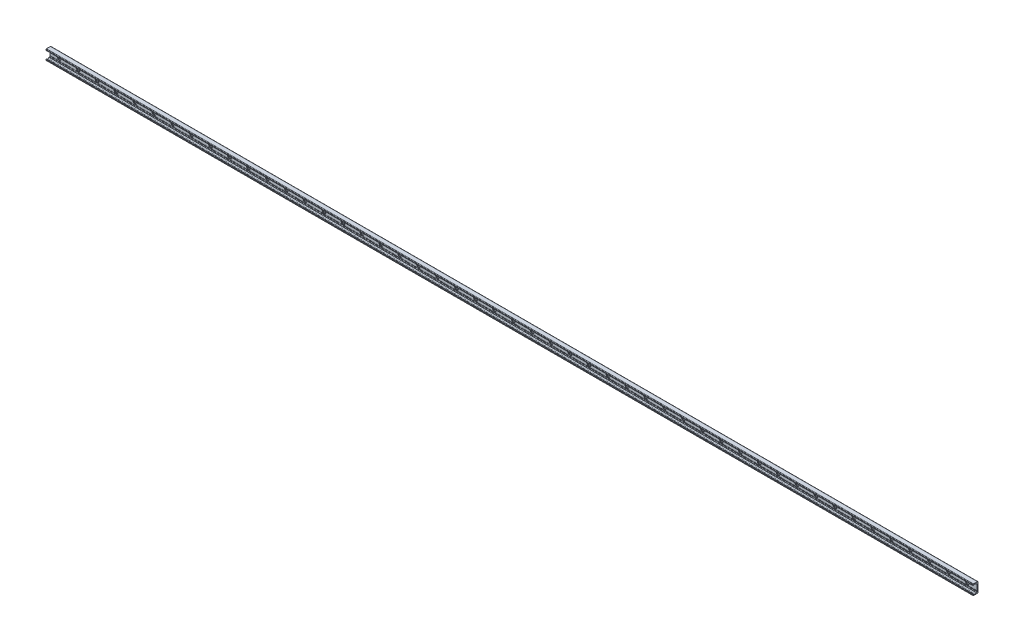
from build123d import *

# Parameters (mm, degrees)
BOSS_EXTRUDE1_DEPTH = 1960
SKETCH2_R           = 9
SKETCH2_R_2         = 4.5
CUT_EXTRUDE1_DEPTH  = 3.1
SKETCH2_2_R         = 4.5
CUT_EXTRUDE2_DEPTH  = 1961.187363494
LPATTERN1_COUNT     = 49
LPATTERN1_PITCH     = 80


with BuildPart() as part:
    # Sketch1 → Boss-Extrude1 (new, symmetric)
    with BuildSketch(Plane(origin=(0, 0, 0), x_dir=(0, 0, -1), z_dir=(1, 0, 0))):
        with BuildLine():
            Line((0, 0), (0, 19))
            ThreePointArc((0, 19), (-0.732233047, 20.767766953), (-2.5, 21.5))
            Line((-2.5, 21.5), (-19, 21.5))
            ThreePointArc((-19, 21.5), (-20.414213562, 20.914213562), (-21, 19.5))
            Line((-21, 19.5), (-21, 16.625057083))
            ThreePointArc((-21, 16.625057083), (-20.553251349, 15.888838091), (-19.693931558, 15.945160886))
            Line((-19.693931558, 15.945160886), (-16.794305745, 17.975500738))
            ThreePointArc((-16.794305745, 17.975500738), (-14.5, 18.69889256), (-12.205694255, 17.975500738))
            Line((-12.205694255, 17.975500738), (-8.829831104, 15.611695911))
            ThreePointArc((-8.829831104, 15.611695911), (-8.28408983, 15.342566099), (-7.682678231, 15.25))
            Line((-7.682678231, 15.25), (-6.5, 15.25))
            ThreePointArc((-6.5, 15.25), (-5.085786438, 14.664213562), (-4.5, 13.25))
            Line((-4.5, 13.25), (-4.5, -10.75))
            ThreePointArc((-4.5, -10.75), (-4.25, -11), (-4.5, -11.25))
            Line((-4.5, -11.25), (-4.5, -12.25))
            ThreePointArc((-4.5, -12.25), (-4.25, -12.5), (-4.5, -12.75))
            Line((-4.5, -12.75), (-4.5, -13.25))
            ThreePointArc((-4.5, -13.25), (-5.085786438, -14.664213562), (-6.5, -15.25))
            Line((-6.5, -15.25), (-7.682678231, -15.25))
            ThreePointArc((-7.682678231, -15.25), (-8.28408983, -15.342566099), (-8.829831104, -15.611695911))
            Line((-8.829831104, -15.611695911), (-12.205694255, -17.975500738))
            ThreePointArc((-12.205694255, -17.975500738), (-14.5, -18.69889256), (-16.794305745, -17.975500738))
            Line((-16.794305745, -17.975500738), (-19.693931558, -15.945160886))
            ThreePointArc((-19.693931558, -15.945160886), (-20.553251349, -15.888838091), (-21, -16.625057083))
            Line((-21, -16.625057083), (-21, -19.5))
            ThreePointArc((-21, -19.5), (-20.414213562, -20.914213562), (-19, -21.5))
            Line((-19, -21.5), (-2.5, -21.5))
            ThreePointArc((-2.5, -21.5), (-0.732233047, -20.767766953), (0, -19))
            Line((0, -19), (0, 0))
        make_face()
    extrude(amount=BOSS_EXTRUDE1_DEPTH, both=True)

    # Sketch2 → Cut-Extrude1 (cut)
    with BuildSketch(Plane.XY.offset(4.5)):
        with Locations((1920, 0)):
            Circle(SKETCH2_R)
        with Locations((1920, 0)):
            Circle(SKETCH2_R_2, mode=Mode.SUBTRACT)
    cut_extrude1 = extrude(amount=-CUT_EXTRUDE1_DEPTH, mode=Mode.SUBTRACT)

    # Sketch2_2 → Cut-Extrude2 (cut, through all)
    with BuildSketch(Plane.XY.offset(4.5)):
        with Locations((1920, 0)):
            Circle(SKETCH2_2_R)
    cut_extrude2 = extrude(amount=-CUT_EXTRUDE2_DEPTH, mode=Mode.SUBTRACT)

    # LPattern1: Cut-Extrude1, Cut-Extrude2 ×49
    with Locations(*[(-i * LPATTERN1_PITCH, 0, 0) for i in range(1, LPATTERN1_COUNT)]):
        add(cut_extrude1, mode=Mode.SUBTRACT)
        add(cut_extrude2, mode=Mode.SUBTRACT)


solid = part.part
